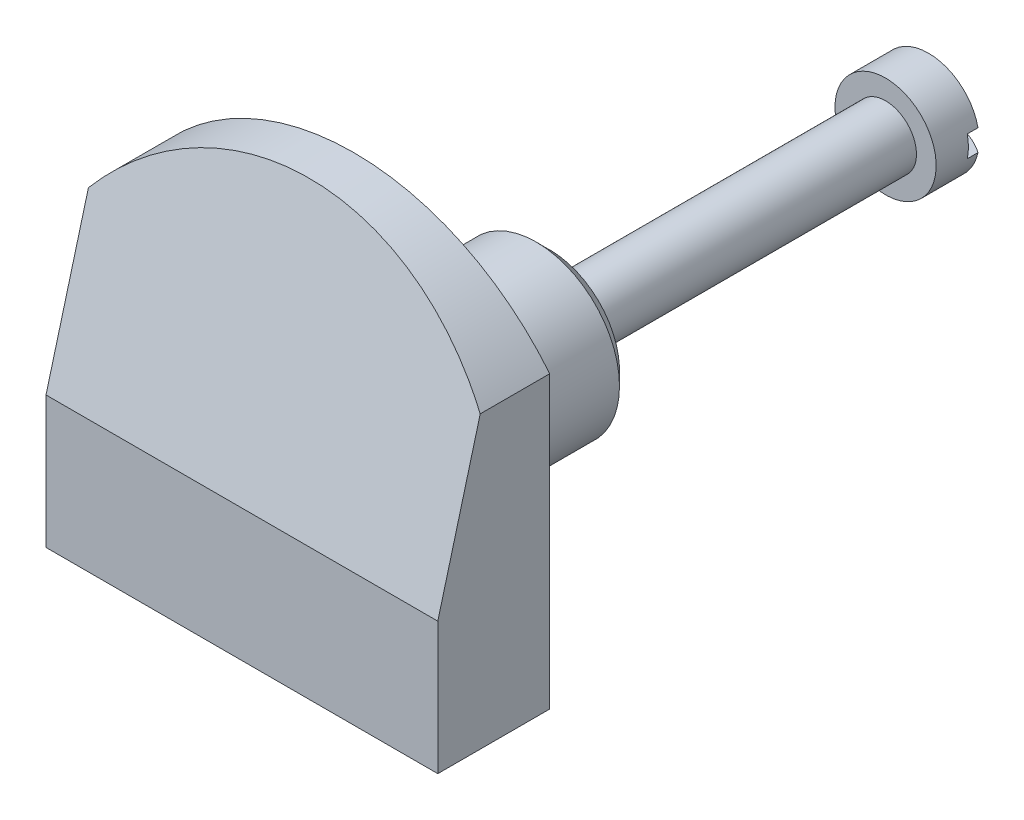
ISO-10303-21;
HEADER;
FILE_DESCRIPTION(('STEP AP214'),'2;1');
FILE_NAME('part.step','',(''),(''),'','','');
FILE_SCHEMA(('AUTOMOTIVE_DESIGN { 1 0 10303 214 1 1 1 1 }'));
ENDSEC;
DATA;
#1=APPLICATION_CONTEXT('core data for automotive mechanical design processes');
#2=APPLICATION_PROTOCOL_DEFINITION('international standard','automotive_design',2000,#1);
#3=PRODUCT_CONTEXT('',#1,'mechanical');
#4=PRODUCT('Part','Part','',(#3));
#5=PRODUCT_RELATED_PRODUCT_CATEGORY('part','',(#4));
#6=PRODUCT_DEFINITION_FORMATION('','',#4);
#7=PRODUCT_DEFINITION_CONTEXT('part definition',#1,'design');
#8=PRODUCT_DEFINITION('design','',#6,#7);
#9=PRODUCT_DEFINITION_SHAPE('','',#8);
#10=(LENGTH_UNIT() NAMED_UNIT(*) SI_UNIT(.MILLI.,.METRE.));
#11=(NAMED_UNIT(*) PLANE_ANGLE_UNIT() SI_UNIT($,.RADIAN.));
#12=(NAMED_UNIT(*) SI_UNIT($,.STERADIAN.) SOLID_ANGLE_UNIT());
#13=UNCERTAINTY_MEASURE_WITH_UNIT(LENGTH_MEASURE(1.E-05),#10,'distance_accuracy_value','');
#14=(GEOMETRIC_REPRESENTATION_CONTEXT(3) GLOBAL_UNCERTAINTY_ASSIGNED_CONTEXT((#13)) GLOBAL_UNIT_ASSIGNED_CONTEXT((#10,
#11,#12)) REPRESENTATION_CONTEXT('',''));
#15=CARTESIAN_POINT('',(0.,0.,0.));
#16=DIRECTION('',(0.,0.,1.));
#17=DIRECTION('',(1.,0.,0.));
#18=AXIS2_PLACEMENT_3D('',#15,#16,#17);
#19=CARTESIAN_POINT('',(0.,0.,0.));
#20=DIRECTION('',(0.,0.,1.));
#21=DIRECTION('',(1.,0.,0.));
#22=AXIS2_PLACEMENT_3D('',#19,#20,#21);
#23=PLANE('',#22);
#24=CARTESIAN_POINT('',(0.,0.,0.));
#25=DIRECTION('',(0.,0.,1.));
#26=DIRECTION('',(1.,0.,0.));
#27=AXIS2_PLACEMENT_3D('',#24,#25,#26);
#28=CIRCLE('',#27,4.97205);
#29=CARTESIAN_POINT('',(4.97205,0.,0.));
#30=VERTEX_POINT('',#29);
#31=EDGE_CURVE('E167',#30,#30,#28,.T.);
#32=ORIENTED_EDGE('',*,*,#31,.T.);
#33=EDGE_LOOP('',(#32));
#34=FACE_BOUND('',#33,.T.);
#35=DIRECTION('',(0.,1.,0.));
#36=VECTOR('',#35,1.);
#37=CARTESIAN_POINT('',(11.1125,-7.493,0.));
#38=LINE('',#37,#36);
#39=CARTESIAN_POINT('',(11.1125,-7.493,0.));
#40=VERTEX_POINT('',#39);
#41=CARTESIAN_POINT('',(11.1125,8.98025612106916,0.));
#42=VERTEX_POINT('',#41);
#43=EDGE_CURVE('E132',#40,#42,#38,.T.);
#44=ORIENTED_EDGE('',*,*,#43,.F.);
#45=DIRECTION('',(1.,0.,0.));
#46=VECTOR('',#45,1.);
#47=CARTESIAN_POINT('',(-11.1125,-7.493,0.));
#48=LINE('',#47,#46);
#49=CARTESIAN_POINT('',(-11.1125,-7.493,0.));
#50=VERTEX_POINT('',#49);
#51=EDGE_CURVE('E140',#50,#40,#48,.T.);
#52=ORIENTED_EDGE('',*,*,#51,.F.);
#53=DIRECTION('',(0.,-1.,0.));
#54=VECTOR('',#53,1.);
#55=CARTESIAN_POINT('',(-11.1125,-7.493,0.));
#56=LINE('',#55,#54);
#57=CARTESIAN_POINT('',(-11.1125,8.98025612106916,0.));
#58=VERTEX_POINT('',#57);
#59=EDGE_CURVE('E138',#58,#50,#56,.T.);
#60=ORIENTED_EDGE('',*,*,#59,.F.);
#61=CARTESIAN_POINT('',(0.,0.,0.));
#62=DIRECTION('',(0.,0.,1.));
#63=DIRECTION('',(1.,0.,0.));
#64=AXIS2_PLACEMENT_3D('',#61,#62,#63);
#65=CIRCLE('',#64,14.2875);
#66=EDGE_CURVE('E135',#42,#58,#65,.T.);
#67=ORIENTED_EDGE('',*,*,#66,.F.);
#68=EDGE_LOOP('',(#44,#52,#60,#67));
#69=FACE_BOUND('',#68,.T.);
#70=ADVANCED_FACE('F14',(#34,#69),#23,.F.);
#71=CARTESIAN_POINT('',(11.1125,-7.493,6.35));
#72=DIRECTION('',(-1.,0.,0.));
#73=DIRECTION('',(0.,-1.,0.));
#74=AXIS2_PLACEMENT_3D('',#71,#72,#73);
#75=PLANE('',#74);
#76=DIRECTION('',(0.,0.,-1.));
#77=VECTOR('',#76,1.);
#78=CARTESIAN_POINT('',(11.1125,8.98025612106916,6.35));
#79=LINE('',#78,#77);
#80=CARTESIAN_POINT('',(11.1125,8.98025612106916,3.94374762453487));
#81=VERTEX_POINT('',#80);
#82=EDGE_CURVE('E155',#81,#42,#79,.T.);
#83=ORIENTED_EDGE('',*,*,#82,.F.);
#84=DIRECTION('',(0.,-0.965925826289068,0.258819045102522));
#85=VECTOR('',#84,1.);
#86=CARTESIAN_POINT('',(11.1125,-6.9910641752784,8.22325));
#87=LINE('',#86,#85);
#88=CARTESIAN_POINT('',(11.1125,0.,6.35));
#89=VERTEX_POINT('',#88);
#90=EDGE_CURVE('E129',#81,#89,#87,.T.);
#91=ORIENTED_EDGE('',*,*,#90,.T.);
#92=DIRECTION('',(0.,1.,0.));
#93=VECTOR('',#92,1.);
#94=CARTESIAN_POINT('',(11.1125,-7.493,6.35));
#95=LINE('',#94,#93);
#96=CARTESIAN_POINT('',(11.1125,-7.493,6.35));
#97=VERTEX_POINT('',#96);
#98=EDGE_CURVE('E142',#97,#89,#95,.T.);
#99=ORIENTED_EDGE('',*,*,#98,.F.);
#100=DIRECTION('',(0.,0.,-1.));
#101=VECTOR('',#100,1.);
#102=CARTESIAN_POINT('',(11.1125,-7.493,6.35));
#103=LINE('',#102,#101);
#104=EDGE_CURVE('E147',#97,#40,#103,.T.);
#105=ORIENTED_EDGE('',*,*,#104,.T.);
#106=ORIENTED_EDGE('',*,*,#43,.T.);
#107=EDGE_LOOP('',(#83,#91,#99,#105,#106));
#108=FACE_BOUND('',#107,.T.);
#109=ADVANCED_FACE('F16',(#108),#75,.F.);
#110=CARTESIAN_POINT('',(0.,0.,6.35));
#111=DIRECTION('',(0.,0.,-1.));
#112=DIRECTION('',(-1.,0.,0.));
#113=AXIS2_PLACEMENT_3D('',#110,#111,#112);
#114=CYLINDRICAL_SURFACE('',#113,14.2875);
#115=DIRECTION('',(0.,0.,-1.));
#116=VECTOR('',#115,1.);
#117=CARTESIAN_POINT('',(-11.1125,8.98025612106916,6.35));
#118=LINE('',#117,#116);
#119=CARTESIAN_POINT('',(-11.1125,8.98025612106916,3.94374762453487));
#120=VERTEX_POINT('',#119);
#121=EDGE_CURVE('E153',#120,#58,#118,.T.);
#122=ORIENTED_EDGE('',*,*,#121,.F.);
#123=CARTESIAN_POINT('',(0.,0.,6.35));
#124=DIRECTION('',(0.,-0.258819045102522,-0.965925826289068));
#125=DIRECTION('',(0.,0.965925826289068,-0.258819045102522));
#126=AXIS2_PLACEMENT_3D('',#123,#124,#125);
#127=ELLIPSE('',#126,14.7915084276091,14.2875);
#128=EDGE_CURVE('E126',#120,#81,#127,.T.);
#129=ORIENTED_EDGE('',*,*,#128,.T.);
#130=ORIENTED_EDGE('',*,*,#82,.T.);
#131=ORIENTED_EDGE('',*,*,#66,.T.);
#132=EDGE_LOOP('',(#122,#129,#130,#131));
#133=FACE_BOUND('',#132,.T.);
#134=ADVANCED_FACE('F202',(#133),#114,.T.);
#135=CARTESIAN_POINT('',(-11.1125,-7.493,6.35));
#136=DIRECTION('',(1.,0.,0.));
#137=DIRECTION('',(0.,1.,0.));
#138=AXIS2_PLACEMENT_3D('',#135,#136,#137);
#139=PLANE('',#138);
#140=DIRECTION('',(0.,-1.,0.));
#141=VECTOR('',#140,1.);
#142=CARTESIAN_POINT('',(-11.1125,-7.493,6.35));
#143=LINE('',#142,#141);
#144=CARTESIAN_POINT('',(-11.1125,0.,6.35));
#145=VERTEX_POINT('',#144);
#146=CARTESIAN_POINT('',(-11.1125,-7.493,6.35));
#147=VERTEX_POINT('',#146);
#148=EDGE_CURVE('E144',#145,#147,#143,.T.);
#149=ORIENTED_EDGE('',*,*,#148,.F.);
#150=DIRECTION('',(0.,0.965925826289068,-0.258819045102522));
#151=VECTOR('',#150,1.);
#152=CARTESIAN_POINT('',(-11.1125,-6.9910641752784,8.22325));
#153=LINE('',#152,#151);
#154=EDGE_CURVE('E72',#145,#120,#153,.T.);
#155=ORIENTED_EDGE('',*,*,#154,.T.);
#156=ORIENTED_EDGE('',*,*,#121,.T.);
#157=ORIENTED_EDGE('',*,*,#59,.T.);
#158=DIRECTION('',(0.,0.,-1.));
#159=VECTOR('',#158,1.);
#160=CARTESIAN_POINT('',(-11.1125,-7.493,6.35));
#161=LINE('',#160,#159);
#162=EDGE_CURVE('E150',#147,#50,#161,.T.);
#163=ORIENTED_EDGE('',*,*,#162,.F.);
#164=EDGE_LOOP('',(#149,#155,#156,#157,#163));
#165=FACE_BOUND('',#164,.T.);
#166=ADVANCED_FACE('F215',(#165),#139,.F.);
#167=CARTESIAN_POINT('',(-11.1125,-7.493,6.35));
#168=DIRECTION('',(0.,1.,0.));
#169=DIRECTION('',(0.,0.,1.));
#170=AXIS2_PLACEMENT_3D('',#167,#168,#169);
#171=PLANE('',#170);
#172=ORIENTED_EDGE('',*,*,#51,.T.);
#173=ORIENTED_EDGE('',*,*,#104,.F.);
#174=DIRECTION('',(1.,0.,0.));
#175=VECTOR('',#174,1.);
#176=CARTESIAN_POINT('',(-11.1125,-7.493,6.35));
#177=LINE('',#176,#175);
#178=EDGE_CURVE('E66',#147,#97,#177,.T.);
#179=ORIENTED_EDGE('',*,*,#178,.F.);
#180=ORIENTED_EDGE('',*,*,#162,.T.);
#181=EDGE_LOOP('',(#172,#173,#179,#180));
#182=FACE_BOUND('',#181,.T.);
#183=ADVANCED_FACE('F212',(#182),#171,.F.);
#184=CARTESIAN_POINT('',(0.,0.,6.35));
#185=DIRECTION('',(0.,0.,1.));
#186=DIRECTION('',(1.,0.,0.));
#187=AXIS2_PLACEMENT_3D('',#184,#185,#186);
#188=PLANE('',#187);
#189=DIRECTION('',(1.,0.,0.));
#190=VECTOR('',#189,1.);
#191=CARTESIAN_POINT('',(0.,0.,6.35));
#192=LINE('',#191,#190);
#193=EDGE_CURVE('E157',#145,#89,#192,.T.);
#194=ORIENTED_EDGE('',*,*,#193,.F.);
#195=ORIENTED_EDGE('',*,*,#148,.T.);
#196=ORIENTED_EDGE('',*,*,#178,.T.);
#197=ORIENTED_EDGE('',*,*,#98,.T.);
#198=EDGE_LOOP('',(#194,#195,#196,#197));
#199=FACE_BOUND('',#198,.T.);
#200=ADVANCED_FACE('F209',(#199),#188,.T.);
#201=CARTESIAN_POINT('',(-12.7,0.,6.35));
#202=DIRECTION('',(0.,-0.258819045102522,-0.965925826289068));
#203=DIRECTION('',(0.,0.965925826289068,-0.258819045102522));
#204=AXIS2_PLACEMENT_3D('',#201,#202,#203);
#205=PLANE('',#204);
#206=ORIENTED_EDGE('',*,*,#128,.F.);
#207=ORIENTED_EDGE('',*,*,#154,.F.);
#208=ORIENTED_EDGE('',*,*,#193,.T.);
#209=ORIENTED_EDGE('',*,*,#90,.F.);
#210=EDGE_LOOP('',(#206,#207,#208,#209));
#211=FACE_BOUND('',#210,.T.);
#212=ADVANCED_FACE('F207',(#211),#205,.F.);
#213=CARTESIAN_POINT('',(0.,0.,-11.1125));
#214=DIRECTION('',(0.,0.,1.));
#215=DIRECTION('',(1.,0.,0.));
#216=AXIS2_PLACEMENT_3D('',#213,#214,#215);
#217=CYLINDRICAL_SURFACE('',#216,4.71805);
#218=CARTESIAN_POINT('',(0.,0.,-0.254));
#219=DIRECTION('',(0.,0.,1.));
#220=DIRECTION('',(1.,0.,0.));
#221=AXIS2_PLACEMENT_3D('',#218,#219,#220);
#222=CIRCLE('',#221,4.71805);
#223=CARTESIAN_POINT('',(4.71805,0.,-0.254));
#224=VERTEX_POINT('',#223);
#225=EDGE_CURVE('E165',#224,#224,#222,.F.);
#226=ORIENTED_EDGE('',*,*,#225,.T.);
#227=EDGE_LOOP('',(#226));
#228=FACE_BOUND('',#227,.T.);
#229=CARTESIAN_POINT('',(0.,0.,-10.3505));
#230=DIRECTION('',(0.,0.,-1.));
#231=DIRECTION('',(-1.,0.,0.));
#232=AXIS2_PLACEMENT_3D('',#229,#230,#231);
#233=CIRCLE('',#232,4.71805);
#234=CARTESIAN_POINT('',(-4.71805,0.,-10.3505));
#235=VERTEX_POINT('',#234);
#236=EDGE_CURVE('E162',#235,#235,#233,.F.);
#237=ORIENTED_EDGE('',*,*,#236,.T.);
#238=EDGE_LOOP('',(#237));
#239=FACE_BOUND('',#238,.T.);
#240=ADVANCED_FACE('F234',(#228,#239),#217,.T.);
#241=CARTESIAN_POINT('',(0.,0.,-11.1125));
#242=DIRECTION('',(0.,0.,-1.));
#243=DIRECTION('',(-1.,0.,0.));
#244=AXIS2_PLACEMENT_3D('',#241,#242,#243);
#245=PLANE('',#244);
#246=CARTESIAN_POINT('',(0.,0.,-11.1125));
#247=DIRECTION('',(0.,0.,-1.));
#248=DIRECTION('',(-1.,0.,0.));
#249=AXIS2_PLACEMENT_3D('',#246,#247,#248);
#250=CIRCLE('',#249,3.95605);
#251=CARTESIAN_POINT('',(-3.95605,0.,-11.1125));
#252=VERTEX_POINT('',#251);
#253=EDGE_CURVE('E159',#252,#252,#250,.T.);
#254=ORIENTED_EDGE('',*,*,#253,.T.);
#255=EDGE_LOOP('',(#254));
#256=FACE_BOUND('',#255,.T.);
#257=CARTESIAN_POINT('',(0.,0.,-11.1125));
#258=DIRECTION('',(0.,0.,-1.));
#259=DIRECTION('',(0.,-1.,0.));
#260=AXIS2_PLACEMENT_3D('',#257,#258,#259);
#261=CIRCLE('',#260,1.7526);
#262=CARTESIAN_POINT('',(0.,-1.7526,-11.1125));
#263=VERTEX_POINT('',#262);
#264=EDGE_CURVE('E9',#263,#263,#261,.F.);
#265=ORIENTED_EDGE('',*,*,#264,.T.);
#266=EDGE_LOOP('',(#265));
#267=FACE_BOUND('',#266,.T.);
#268=ADVANCED_FACE('F239',(#256,#267),#245,.T.);
#269=CARTESIAN_POINT('',(0.,0.,-11.1125));
#270=DIRECTION('',(0.,0.,1.));
#271=DIRECTION('',(1.,0.,0.));
#272=AXIS2_PLACEMENT_3D('',#269,#270,#271);
#273=CONICAL_SURFACE('',#272,3.95605,0.785398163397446);
#274=ORIENTED_EDGE('',*,*,#236,.F.);
#275=EDGE_LOOP('',(#274));
#276=FACE_BOUND('',#275,.T.);
#277=ORIENTED_EDGE('',*,*,#253,.F.);
#278=EDGE_LOOP('',(#277));
#279=FACE_BOUND('',#278,.T.);
#280=ADVANCED_FACE('F245',(#276,#279),#273,.T.);
#281=CARTESIAN_POINT('',(0.,0.,-0.254));
#282=DIRECTION('',(0.,0.,1.));
#283=DIRECTION('',(1.,0.,0.));
#284=AXIS2_PLACEMENT_3D('',#281,#282,#283);
#285=TOROIDAL_SURFACE('',#284,4.97205,0.254);
#286=ORIENTED_EDGE('',*,*,#31,.F.);
#287=EDGE_LOOP('',(#286));
#288=FACE_BOUND('',#287,.T.);
#289=ORIENTED_EDGE('',*,*,#225,.F.);
#290=EDGE_LOOP('',(#289));
#291=FACE_BOUND('',#290,.T.);
#292=ADVANCED_FACE('F251',(#288,#291),#285,.F.);
#293=CARTESIAN_POINT('',(0.,0.,-28.5534805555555));
#294=DIRECTION('',(0.,0.,-1.));
#295=DIRECTION('',(0.,1.,0.));
#296=AXIS2_PLACEMENT_3D('',#293,#294,#295);
#297=SPHERICAL_SURFACE('',#296,4.96181944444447);
#298=CARTESIAN_POINT('',(0.,0.,-32.6009));
#299=DIRECTION('',(0.,0.,-1.));
#300=DIRECTION('',(-1.,0.,0.));
#301=AXIS2_PLACEMENT_3D('',#298,#299,#300);
#302=CIRCLE('',#301,2.8702);
#303=CARTESIAN_POINT('',(2.80471672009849,-0.6096,-32.6009));
#304=VERTEX_POINT('',#303);
#305=CARTESIAN_POINT('',(-2.80471672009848,-0.6096,-32.6009));
#306=VERTEX_POINT('',#305);
#307=EDGE_CURVE('E105',#304,#306,#302,.T.);
#308=ORIENTED_EDGE('',*,*,#307,.T.);
#309=CARTESIAN_POINT('',(0.,-0.6096,-28.5534805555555));
#310=DIRECTION('',(0.,1.,0.));
#311=DIRECTION('',(-1.,0.,0.));
#312=AXIS2_PLACEMENT_3D('',#309,#310,#311);
#313=CIRCLE('',#312,4.92422989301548);
#314=EDGE_CURVE('E91',#306,#304,#313,.F.);
#315=ORIENTED_EDGE('',*,*,#314,.T.);
#316=EDGE_LOOP('',(#308,#315));
#317=FACE_BOUND('',#316,.T.);
#318=ADVANCED_FACE('F110',(#317),#297,.T.);
#319=CARTESIAN_POINT('',(-2.80471672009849,0.6096,-32.6009));
#320=VERTEX_POINT('',#319);
#321=CARTESIAN_POINT('',(2.80471672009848,0.6096,-32.6009));
#322=VERTEX_POINT('',#321);
#323=EDGE_CURVE('E111',#320,#322,#302,.T.);
#324=ORIENTED_EDGE('',*,*,#323,.T.);
#325=CARTESIAN_POINT('',(0.,0.6096,-28.5534805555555));
#326=DIRECTION('',(0.,-1.,0.));
#327=DIRECTION('',(1.,0.,0.));
#328=AXIS2_PLACEMENT_3D('',#325,#326,#327);
#329=CIRCLE('',#328,4.92422989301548);
#330=EDGE_CURVE('E101',#322,#320,#329,.F.);
#331=ORIENTED_EDGE('',*,*,#330,.T.);
#332=EDGE_LOOP('',(#324,#331));
#333=FACE_BOUND('',#332,.T.);
#334=ADVANCED_FACE('F259',(#333),#297,.T.);
#335=CARTESIAN_POINT('',(-2.8702,0.6096,-31.9913));
#336=DIRECTION('',(0.,-1.,0.));
#337=DIRECTION('',(1.,0.,0.));
#338=AXIS2_PLACEMENT_3D('',#335,#336,#337);
#339=PLANE('',#338);
#340=DIRECTION('',(0.,0.,-1.));
#341=VECTOR('',#340,1.);
#342=CARTESIAN_POINT('',(-2.80471672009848,0.6096,-58.9153));
#343=LINE('',#342,#341);
#344=CARTESIAN_POINT('',(-2.80471672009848,0.6096,-31.9913));
#345=VERTEX_POINT('',#344);
#346=EDGE_CURVE('E108',#345,#320,#343,.T.);
#347=ORIENTED_EDGE('',*,*,#346,.T.);
#348=ORIENTED_EDGE('',*,*,#330,.F.);
#349=DIRECTION('',(0.,0.,-1.));
#350=VECTOR('',#349,1.);
#351=CARTESIAN_POINT('',(2.80471672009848,0.6096,-58.9153));
#352=LINE('',#351,#350);
#353=CARTESIAN_POINT('',(2.80471672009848,0.6096,-31.9913));
#354=VERTEX_POINT('',#353);
#355=EDGE_CURVE('E121',#322,#354,#352,.F.);
#356=ORIENTED_EDGE('',*,*,#355,.T.);
#357=DIRECTION('',(-1.,0.,0.));
#358=VECTOR('',#357,1.);
#359=CARTESIAN_POINT('',(-2.8702,0.6096,-31.9913));
#360=LINE('',#359,#358);
#361=EDGE_CURVE('E171',#354,#345,#360,.T.);
#362=ORIENTED_EDGE('',*,*,#361,.T.);
#363=EDGE_LOOP('',(#347,#348,#356,#362));
#364=FACE_BOUND('',#363,.T.);
#365=ADVANCED_FACE('F266',(#364),#339,.T.);
#366=CARTESIAN_POINT('',(-2.8702,-0.6096,-31.9913));
#367=DIRECTION('',(0.,0.,-1.));
#368=DIRECTION('',(-1.,0.,0.));
#369=AXIS2_PLACEMENT_3D('',#366,#367,#368);
#370=PLANE('',#369);
#371=ORIENTED_EDGE('',*,*,#361,.F.);
#372=CARTESIAN_POINT('',(0.,0.,-31.9913));
#373=DIRECTION('',(0.,0.,-1.));
#374=DIRECTION('',(-1.,0.,0.));
#375=AXIS2_PLACEMENT_3D('',#372,#373,#374);
#376=CIRCLE('',#375,2.8702);
#377=CARTESIAN_POINT('',(2.80471672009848,-0.6096,-31.9913));
#378=VERTEX_POINT('',#377);
#379=EDGE_CURVE('E78',#354,#378,#376,.T.);
#380=ORIENTED_EDGE('',*,*,#379,.T.);
#381=DIRECTION('',(1.,0.,0.));
#382=VECTOR('',#381,1.);
#383=CARTESIAN_POINT('',(2.8702,-0.6096,-31.9913));
#384=LINE('',#383,#382);
#385=CARTESIAN_POINT('',(-2.80471672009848,-0.6096,-31.9913));
#386=VERTEX_POINT('',#385);
#387=EDGE_CURVE('E31',#386,#378,#384,.T.);
#388=ORIENTED_EDGE('',*,*,#387,.F.);
#389=EDGE_CURVE('E107',#386,#345,#376,.T.);
#390=ORIENTED_EDGE('',*,*,#389,.T.);
#391=EDGE_LOOP('',(#371,#380,#388,#390));
#392=FACE_BOUND('',#391,.T.);
#393=ADVANCED_FACE('F274',(#392),#370,.T.);
#394=CARTESIAN_POINT('',(2.8702,-0.6096,-31.9913));
#395=DIRECTION('',(0.,1.,0.));
#396=DIRECTION('',(-1.,0.,0.));
#397=AXIS2_PLACEMENT_3D('',#394,#395,#396);
#398=PLANE('',#397);
#399=DIRECTION('',(0.,0.,-1.));
#400=VECTOR('',#399,1.);
#401=CARTESIAN_POINT('',(2.80471672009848,-0.6096,-58.9153));
#402=LINE('',#401,#400);
#403=EDGE_CURVE('E23',#378,#304,#402,.T.);
#404=ORIENTED_EDGE('',*,*,#403,.T.);
#405=ORIENTED_EDGE('',*,*,#314,.F.);
#406=DIRECTION('',(0.,0.,-1.));
#407=VECTOR('',#406,1.);
#408=CARTESIAN_POINT('',(-2.80471672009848,-0.6096,-58.9153));
#409=LINE('',#408,#407);
#410=EDGE_CURVE('E94',#306,#386,#409,.F.);
#411=ORIENTED_EDGE('',*,*,#410,.T.);
#412=ORIENTED_EDGE('',*,*,#387,.T.);
#413=EDGE_LOOP('',(#404,#405,#411,#412));
#414=FACE_BOUND('',#413,.T.);
#415=ADVANCED_FACE('F93',(#414),#398,.T.);
#416=CARTESIAN_POINT('',(0.,0.,-58.9153));
#417=DIRECTION('',(0.,0.,-1.));
#418=DIRECTION('',(-1.,0.,0.));
#419=AXIS2_PLACEMENT_3D('',#416,#417,#418);
#420=CYLINDRICAL_SURFACE('',#419,2.8702);
#421=CARTESIAN_POINT('',(0.,0.,-30.1625));
#422=DIRECTION('',(0.,0.,-1.));
#423=DIRECTION('',(-1.,0.,0.));
#424=AXIS2_PLACEMENT_3D('',#421,#422,#423);
#425=CIRCLE('',#424,2.8702);
#426=CARTESIAN_POINT('',(-2.8702,0.,-30.1625));
#427=VERTEX_POINT('',#426);
#428=EDGE_CURVE('E112',#427,#427,#425,.T.);
#429=ORIENTED_EDGE('',*,*,#428,.T.);
#430=EDGE_LOOP('',(#429));
#431=FACE_BOUND('',#430,.T.);
#432=ORIENTED_EDGE('',*,*,#403,.F.);
#433=ORIENTED_EDGE('',*,*,#379,.F.);
#434=ORIENTED_EDGE('',*,*,#355,.F.);
#435=ORIENTED_EDGE('',*,*,#323,.F.);
#436=ORIENTED_EDGE('',*,*,#346,.F.);
#437=ORIENTED_EDGE('',*,*,#389,.F.);
#438=ORIENTED_EDGE('',*,*,#410,.F.);
#439=ORIENTED_EDGE('',*,*,#307,.F.);
#440=EDGE_LOOP('',(#432,#433,#434,#435,#436,#437,#438,#439));
#441=FACE_BOUND('',#440,.T.);
#442=ADVANCED_FACE('F104',(#431,#441),#420,.T.);
#443=CARTESIAN_POINT('',(0.,1.7526,-30.1625));
#444=DIRECTION('',(0.,0.,-1.));
#445=DIRECTION('',(-1.,0.,0.));
#446=AXIS2_PLACEMENT_3D('',#443,#444,#445);
#447=PLANE('',#446);
#448=ORIENTED_EDGE('',*,*,#428,.F.);
#449=EDGE_LOOP('',(#448));
#450=FACE_BOUND('',#449,.T.);
#451=CARTESIAN_POINT('',(0.,0.,-30.1625));
#452=DIRECTION('',(0.,0.,-1.));
#453=DIRECTION('',(-1.,0.,0.));
#454=AXIS2_PLACEMENT_3D('',#451,#452,#453);
#455=CIRCLE('',#454,1.7526);
#456=CARTESIAN_POINT('',(-1.7526,0.,-30.1625));
#457=VERTEX_POINT('',#456);
#458=EDGE_CURVE('E100',#457,#457,#455,.T.);
#459=ORIENTED_EDGE('',*,*,#458,.T.);
#460=EDGE_LOOP('',(#459));
#461=FACE_BOUND('',#460,.T.);
#462=ADVANCED_FACE('F180',(#450,#461),#447,.F.);
#463=CARTESIAN_POINT('',(0.,0.,-58.9153));
#464=DIRECTION('',(0.,0.,-1.));
#465=DIRECTION('',(-1.,0.,0.));
#466=AXIS2_PLACEMENT_3D('',#463,#464,#465);
#467=CYLINDRICAL_SURFACE('',#466,1.7526);
#468=ORIENTED_EDGE('',*,*,#264,.F.);
#469=EDGE_LOOP('',(#468));
#470=FACE_BOUND('',#469,.T.);
#471=ORIENTED_EDGE('',*,*,#458,.F.);
#472=EDGE_LOOP('',(#471));
#473=FACE_BOUND('',#472,.T.);
#474=ADVANCED_FACE('F182',(#470,#473),#467,.T.);
#475=CLOSED_SHELL('',(#70,#109,#134,#166,#183,#200,#212,#240,#268,#280,#292,#318,#334,#365,#393,
#415,#442,#462,#474));
#476=MANIFOLD_SOLID_BREP('B1',#475);
#477=ADVANCED_BREP_SHAPE_REPRESENTATION('',(#18,#476),#14);
#478=SHAPE_DEFINITION_REPRESENTATION(#9,#477);
ENDSEC;
END-ISO-10303-21;
